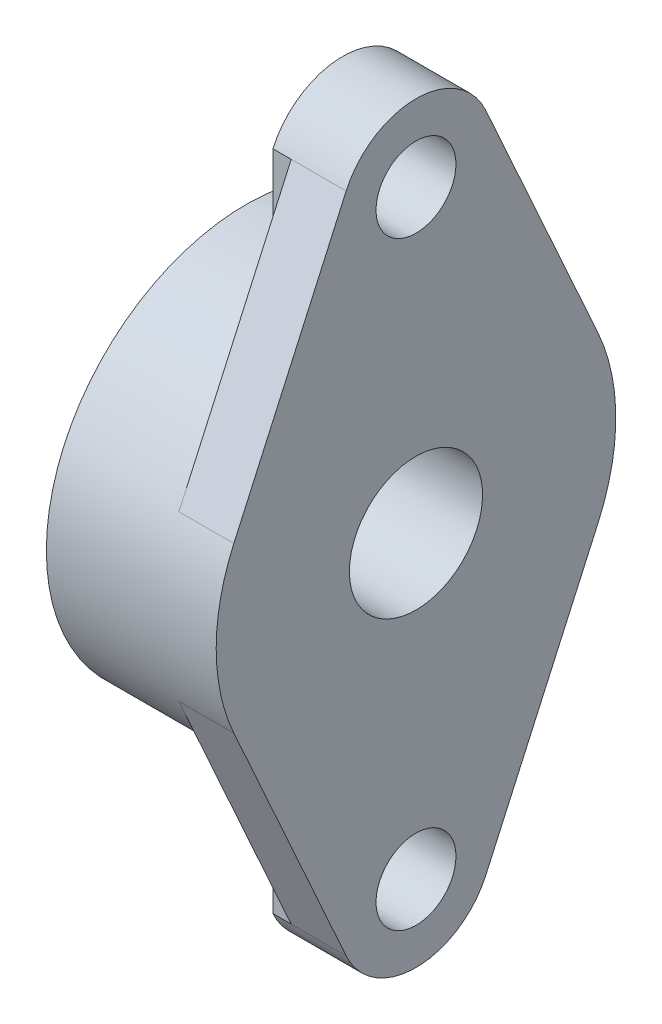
ISO-10303-21;
HEADER;
FILE_DESCRIPTION(('STEP AP214'),'2;1');
FILE_NAME('part.step','',(''),(''),'','','');
FILE_SCHEMA(('AUTOMOTIVE_DESIGN { 1 0 10303 214 1 1 1 1 }'));
ENDSEC;
DATA;
#1=APPLICATION_CONTEXT('core data for automotive mechanical design processes');
#2=APPLICATION_PROTOCOL_DEFINITION('international standard','automotive_design',2000,#1);
#3=PRODUCT_CONTEXT('',#1,'mechanical');
#4=PRODUCT('Part','Part','',(#3));
#5=PRODUCT_RELATED_PRODUCT_CATEGORY('part','',(#4));
#6=PRODUCT_DEFINITION_FORMATION('','',#4);
#7=PRODUCT_DEFINITION_CONTEXT('part definition',#1,'design');
#8=PRODUCT_DEFINITION('design','',#6,#7);
#9=PRODUCT_DEFINITION_SHAPE('','',#8);
#10=(LENGTH_UNIT() NAMED_UNIT(*) SI_UNIT(.MILLI.,.METRE.));
#11=(NAMED_UNIT(*) PLANE_ANGLE_UNIT() SI_UNIT($,.RADIAN.));
#12=(NAMED_UNIT(*) SI_UNIT($,.STERADIAN.) SOLID_ANGLE_UNIT());
#13=UNCERTAINTY_MEASURE_WITH_UNIT(LENGTH_MEASURE(1.E-05),#10,'distance_accuracy_value','');
#14=(GEOMETRIC_REPRESENTATION_CONTEXT(3) GLOBAL_UNCERTAINTY_ASSIGNED_CONTEXT((#13)) GLOBAL_UNIT_ASSIGNED_CONTEXT((#10,
#11,#12)) REPRESENTATION_CONTEXT('',''));
#15=CARTESIAN_POINT('',(0.,0.,0.));
#16=DIRECTION('',(0.,0.,1.));
#17=DIRECTION('',(1.,0.,0.));
#18=AXIS2_PLACEMENT_3D('',#15,#16,#17);
#19=CARTESIAN_POINT('',(-8.25,-49.9521254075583,-27.3475572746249));
#20=DIRECTION('',(-1.,0.,0.));
#21=DIRECTION('',(0.,0.,1.));
#22=AXIS2_PLACEMENT_3D('',#19,#20,#21);
#23=PLANE('',#22);
#24=DIRECTION('',(0.,-1.,0.));
#25=VECTOR('',#24,1.);
#26=CARTESIAN_POINT('',(-8.25,-38.9182643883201,-10.4832302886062));
#27=LINE('',#26,#25);
#28=CARTESIAN_POINT('',(-8.25,-28.1087509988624,-10.4832302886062));
#29=VERTEX_POINT('',#28);
#30=CARTESIAN_POINT('',(-8.25,-49.7277777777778,-10.4832302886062));
#31=VERTEX_POINT('',#30);
#32=EDGE_CURVE('E71',#29,#31,#27,.T.);
#33=ORIENTED_EDGE('',*,*,#32,.F.);
#34=CARTESIAN_POINT('',(-8.25,0.,0.));
#35=DIRECTION('',(-1.,0.,0.));
#36=DIRECTION('',(0.,0.,1.));
#37=AXIS2_PLACEMENT_3D('',#34,#35,#36);
#38=CIRCLE('',#37,30.);
#39=CARTESIAN_POINT('',(-8.25,-12.3365061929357,-27.3461262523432));
#40=VERTEX_POINT('',#39);
#41=EDGE_CURVE('E208',#40,#29,#38,.T.);
#42=ORIENTED_EDGE('',*,*,#41,.F.);
#43=DIRECTION('',(0.,0.911585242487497,-0.411111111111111));
#44=VECTOR('',#43,1.);
#45=CARTESIAN_POINT('',(-8.25,-31.0305555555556,-18.9153937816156));
#46=LINE('',#45,#44);
#47=EDGE_CURVE('E308',#31,#40,#46,.T.);
#48=ORIENTED_EDGE('',*,*,#47,.F.);
#49=EDGE_LOOP('',(#33,#42,#48));
#50=FACE_BOUND('',#49,.T.);
#51=ADVANCED_FACE('F16',(#50),#23,.T.);
#52=CARTESIAN_POINT('',(-11.,-49.7277777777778,-10.4832302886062));
#53=DIRECTION('',(0.,0.,-1.));
#54=DIRECTION('',(0.,1.,0.));
#55=AXIS2_PLACEMENT_3D('',#52,#53,#54);
#56=PLANE('',#55);
#57=DIRECTION('',(0.,-1.,0.));
#58=VECTOR('',#57,1.);
#59=CARTESIAN_POINT('',(-11.,-42.4463317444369,-10.4832302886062));
#60=LINE('',#59,#58);
#61=CARTESIAN_POINT('',(-11.,-28.1087509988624,-10.4832302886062));
#62=VERTEX_POINT('',#61);
#63=CARTESIAN_POINT('',(-11.,-49.7277777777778,-10.4832302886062));
#64=VERTEX_POINT('',#63);
#65=EDGE_CURVE('E65',#62,#64,#60,.T.);
#66=ORIENTED_EDGE('',*,*,#65,.F.);
#67=DIRECTION('',(-1.,0.,0.));
#68=VECTOR('',#67,1.);
#69=CARTESIAN_POINT('',(-12.75,-28.1087509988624,-10.4832302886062));
#70=LINE('',#69,#68);
#71=EDGE_CURVE('E300',#29,#62,#70,.T.);
#72=ORIENTED_EDGE('',*,*,#71,.F.);
#73=ORIENTED_EDGE('',*,*,#32,.T.);
#74=DIRECTION('',(1.,0.,0.));
#75=VECTOR('',#74,1.);
#76=CARTESIAN_POINT('',(-5.5,-49.7277777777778,-10.4832302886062));
#77=LINE('',#76,#75);
#78=EDGE_CURVE('E316',#64,#31,#77,.T.);
#79=ORIENTED_EDGE('',*,*,#78,.F.);
#80=EDGE_LOOP('',(#66,#72,#73,#79));
#81=FACE_BOUND('',#80,.T.);
#82=ADVANCED_FACE('F482',(#81),#56,.T.);
#83=CARTESIAN_POINT('',(-8.25,12.1121584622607,-27.3475572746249));
#84=DIRECTION('',(-1.,0.,0.));
#85=DIRECTION('',(0.,0.,1.));
#86=AXIS2_PLACEMENT_3D('',#83,#84,#85);
#87=PLANE('',#86);
#88=CARTESIAN_POINT('',(-8.25,0.,0.));
#89=DIRECTION('',(-1.,0.,0.));
#90=DIRECTION('',(0.,0.,1.));
#91=AXIS2_PLACEMENT_3D('',#88,#89,#90);
#92=CIRCLE('',#91,30.);
#93=CARTESIAN_POINT('',(-8.25,28.1087509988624,-10.4832302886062));
#94=VERTEX_POINT('',#93);
#95=CARTESIAN_POINT('',(-8.25,12.3365061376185,-27.3461262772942));
#96=VERTEX_POINT('',#95);
#97=EDGE_CURVE('E360',#94,#96,#92,.T.);
#98=ORIENTED_EDGE('',*,*,#97,.F.);
#99=DIRECTION('',(0.,-1.,0.));
#100=VECTOR('',#99,1.);
#101=CARTESIAN_POINT('',(-8.25,38.9182643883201,-10.4832302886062));
#102=LINE('',#101,#100);
#103=CARTESIAN_POINT('',(-8.25,49.7277777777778,-10.4832302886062));
#104=VERTEX_POINT('',#103);
#105=EDGE_CURVE('E270',#104,#94,#102,.T.);
#106=ORIENTED_EDGE('',*,*,#105,.F.);
#107=DIRECTION('',(0.,0.911585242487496,0.411111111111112));
#108=VECTOR('',#107,1.);
#109=CARTESIAN_POINT('',(-8.25,31.0305555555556,-18.9153937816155));
#110=LINE('',#109,#108);
#111=EDGE_CURVE('E203',#96,#104,#110,.T.);
#112=ORIENTED_EDGE('',*,*,#111,.F.);
#113=EDGE_LOOP('',(#98,#106,#112));
#114=FACE_BOUND('',#113,.T.);
#115=ADVANCED_FACE('F371',(#114),#87,.T.);
#116=CARTESIAN_POINT('',(-11.,28.1087509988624,-10.4832302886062));
#117=DIRECTION('',(0.,0.,-1.));
#118=DIRECTION('',(0.,1.,0.));
#119=AXIS2_PLACEMENT_3D('',#116,#117,#118);
#120=PLANE('',#119);
#121=DIRECTION('',(0.,-1.,0.));
#122=VECTOR('',#121,1.);
#123=CARTESIAN_POINT('',(-11.,42.4463317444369,-10.4832302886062));
#124=LINE('',#123,#122);
#125=CARTESIAN_POINT('',(-11.,49.7277777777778,-10.4832302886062));
#126=VERTEX_POINT('',#125);
#127=CARTESIAN_POINT('',(-11.,28.1087509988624,-10.4832302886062));
#128=VERTEX_POINT('',#127);
#129=EDGE_CURVE('E245',#126,#128,#124,.T.);
#130=ORIENTED_EDGE('',*,*,#129,.F.);
#131=DIRECTION('',(-1.,0.,0.));
#132=VECTOR('',#131,1.);
#133=CARTESIAN_POINT('',(-5.5,49.7277777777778,-10.4832302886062));
#134=LINE('',#133,#132);
#135=EDGE_CURVE('E197',#104,#126,#134,.T.);
#136=ORIENTED_EDGE('',*,*,#135,.F.);
#137=ORIENTED_EDGE('',*,*,#105,.T.);
#138=DIRECTION('',(1.,0.,0.));
#139=VECTOR('',#138,1.);
#140=CARTESIAN_POINT('',(-12.75,28.1087509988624,-10.4832302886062));
#141=LINE('',#140,#139);
#142=EDGE_CURVE('E215',#128,#94,#141,.T.);
#143=ORIENTED_EDGE('',*,*,#142,.F.);
#144=EDGE_LOOP('',(#130,#136,#137,#143));
#145=FACE_BOUND('',#144,.T.);
#146=ADVANCED_FACE('F366',(#145),#120,.T.);
#147=CARTESIAN_POINT('',(-11.,-28.1087509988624,10.4832302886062));
#148=DIRECTION('',(0.,0.,1.));
#149=DIRECTION('',(0.,-1.,0.));
#150=AXIS2_PLACEMENT_3D('',#147,#148,#149);
#151=PLANE('',#150);
#152=DIRECTION('',(0.,1.,0.));
#153=VECTOR('',#152,1.);
#154=CARTESIAN_POINT('',(-11.,-42.4463317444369,10.4832302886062));
#155=LINE('',#154,#153);
#156=CARTESIAN_POINT('',(-11.,-49.7277777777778,10.4832302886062));
#157=VERTEX_POINT('',#156);
#158=CARTESIAN_POINT('',(-11.,-28.1087509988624,10.4832302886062));
#159=VERTEX_POINT('',#158);
#160=EDGE_CURVE('E59',#157,#159,#155,.T.);
#161=ORIENTED_EDGE('',*,*,#160,.F.);
#162=DIRECTION('',(-1.,0.,0.));
#163=VECTOR('',#162,1.);
#164=CARTESIAN_POINT('',(-5.5,-49.7277777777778,10.4832302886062));
#165=LINE('',#164,#163);
#166=CARTESIAN_POINT('',(-8.25,-49.7277777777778,10.4832302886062));
#167=VERTEX_POINT('',#166);
#168=EDGE_CURVE('E257',#167,#157,#165,.T.);
#169=ORIENTED_EDGE('',*,*,#168,.F.);
#170=DIRECTION('',(0.,1.,0.));
#171=VECTOR('',#170,1.);
#172=CARTESIAN_POINT('',(-8.25,-49.7277777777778,10.4832302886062));
#173=LINE('',#172,#171);
#174=CARTESIAN_POINT('',(-8.25,-28.1087509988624,10.4832302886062));
#175=VERTEX_POINT('',#174);
#176=EDGE_CURVE('E251',#175,#167,#173,.F.);
#177=ORIENTED_EDGE('',*,*,#176,.F.);
#178=DIRECTION('',(1.,0.,0.));
#179=VECTOR('',#178,1.);
#180=CARTESIAN_POINT('',(-12.75,-28.1087509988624,10.4832302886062));
#181=LINE('',#180,#179);
#182=EDGE_CURVE('E277',#159,#175,#181,.T.);
#183=ORIENTED_EDGE('',*,*,#182,.F.);
#184=EDGE_LOOP('',(#161,#169,#177,#183));
#185=FACE_BOUND('',#184,.T.);
#186=ADVANCED_FACE('F432',(#185),#151,.T.);
#187=CARTESIAN_POINT('',(-8.25,12.1121585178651,10.4832302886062));
#188=DIRECTION('',(-1.,0.,0.));
#189=DIRECTION('',(0.,0.,1.));
#190=AXIS2_PLACEMENT_3D('',#187,#188,#189);
#191=PLANE('',#190);
#192=DIRECTION('',(0.,1.,0.));
#193=VECTOR('',#192,1.);
#194=CARTESIAN_POINT('',(-8.25,38.9182643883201,10.4832302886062));
#195=LINE('',#194,#193);
#196=CARTESIAN_POINT('',(-8.25,28.1087509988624,10.4832302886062));
#197=VERTEX_POINT('',#196);
#198=CARTESIAN_POINT('',(-8.25,49.7277777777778,10.4832302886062));
#199=VERTEX_POINT('',#198);
#200=EDGE_CURVE('E133',#197,#199,#195,.T.);
#201=ORIENTED_EDGE('',*,*,#200,.F.);
#202=CARTESIAN_POINT('',(-8.25,0.,0.));
#203=DIRECTION('',(-1.,0.,0.));
#204=DIRECTION('',(0.,0.,1.));
#205=AXIS2_PLACEMENT_3D('',#202,#203,#204);
#206=CIRCLE('',#205,30.);
#207=CARTESIAN_POINT('',(-8.25,12.3365061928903,27.3461262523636));
#208=VERTEX_POINT('',#207);
#209=EDGE_CURVE('E184',#208,#197,#206,.T.);
#210=ORIENTED_EDGE('',*,*,#209,.F.);
#211=DIRECTION('',(0.,-0.911585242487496,0.411111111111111));
#212=VECTOR('',#211,1.);
#213=CARTESIAN_POINT('',(-8.25,31.0305555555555,18.9153937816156));
#214=LINE('',#213,#212);
#215=EDGE_CURVE('E274',#199,#208,#214,.T.);
#216=ORIENTED_EDGE('',*,*,#215,.F.);
#217=EDGE_LOOP('',(#201,#210,#216));
#218=FACE_BOUND('',#217,.T.);
#219=ADVANCED_FACE('F420',(#218),#191,.T.);
#220=CARTESIAN_POINT('',(-11.,49.7277777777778,10.4832302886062));
#221=DIRECTION('',(0.,0.,1.));
#222=DIRECTION('',(0.,-1.,0.));
#223=AXIS2_PLACEMENT_3D('',#220,#221,#222);
#224=PLANE('',#223);
#225=DIRECTION('',(0.,1.,0.));
#226=VECTOR('',#225,1.);
#227=CARTESIAN_POINT('',(-11.,42.4463317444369,10.4832302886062));
#228=LINE('',#227,#226);
#229=CARTESIAN_POINT('',(-11.,28.1087509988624,10.4832302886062));
#230=VERTEX_POINT('',#229);
#231=CARTESIAN_POINT('',(-11.,49.7277777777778,10.4832302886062));
#232=VERTEX_POINT('',#231);
#233=EDGE_CURVE('E128',#230,#232,#228,.T.);
#234=ORIENTED_EDGE('',*,*,#233,.F.);
#235=DIRECTION('',(-1.,0.,0.));
#236=VECTOR('',#235,1.);
#237=CARTESIAN_POINT('',(-12.75,28.1087509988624,10.4832302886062));
#238=LINE('',#237,#236);
#239=EDGE_CURVE('E267',#197,#230,#238,.T.);
#240=ORIENTED_EDGE('',*,*,#239,.F.);
#241=ORIENTED_EDGE('',*,*,#200,.T.);
#242=DIRECTION('',(1.,0.,0.));
#243=VECTOR('',#242,1.);
#244=CARTESIAN_POINT('',(-5.5,49.7277777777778,10.4832302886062));
#245=LINE('',#244,#243);
#246=EDGE_CURVE('E284',#232,#199,#245,.T.);
#247=ORIENTED_EDGE('',*,*,#246,.F.);
#248=EDGE_LOOP('',(#234,#240,#241,#247));
#249=FACE_BOUND('',#248,.T.);
#250=ADVANCED_FACE('F424',(#249),#224,.T.);
#251=CARTESIAN_POINT('',(-8.25,-49.9521254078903,10.4832302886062));
#252=DIRECTION('',(-1.,0.,0.));
#253=DIRECTION('',(0.,0.,1.));
#254=AXIS2_PLACEMENT_3D('',#251,#252,#253);
#255=PLANE('',#254);
#256=CARTESIAN_POINT('',(-8.25,0.,0.));
#257=DIRECTION('',(-1.,0.,0.));
#258=DIRECTION('',(0.,0.,1.));
#259=AXIS2_PLACEMENT_3D('',#256,#257,#258);
#260=CIRCLE('',#259,30.);
#261=CARTESIAN_POINT('',(-8.25,-12.3365061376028,27.3461262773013));
#262=VERTEX_POINT('',#261);
#263=EDGE_CURVE('E154',#175,#262,#260,.T.);
#264=ORIENTED_EDGE('',*,*,#263,.F.);
#265=ORIENTED_EDGE('',*,*,#176,.T.);
#266=DIRECTION('',(0.,-0.911585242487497,-0.411111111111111));
#267=VECTOR('',#266,1.);
#268=CARTESIAN_POINT('',(-8.25,-31.0305555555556,18.9153937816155));
#269=LINE('',#268,#267);
#270=EDGE_CURVE('E171',#262,#167,#269,.T.);
#271=ORIENTED_EDGE('',*,*,#270,.F.);
#272=EDGE_LOOP('',(#264,#265,#271));
#273=FACE_BOUND('',#272,.T.);
#274=ADVANCED_FACE('F238',(#273),#255,.T.);
#275=CARTESIAN_POINT('',(-11.,28.1087509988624,10.4832302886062));
#276=CARTESIAN_POINT('',(-11.,56.5,10.4832302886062));
#277=CARTESIAN_POINT('',(-11.,56.7839124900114,10.4832302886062));
#278=B_SPLINE_CURVE_WITH_KNOTS('',1,(#275,#276,#277),.UNSPECIFIED.,.F.,.F.,(2,1,2),(0.,1.,1.01),.UNSPECIFIED.);
#279=DIRECTION('',(0.,0.,-1.));
#280=VECTOR('',#279,1.);
#281=SURFACE_OF_LINEAR_EXTRUSION('',#278,#280);
#282=CARTESIAN_POINT('',(-11.,45.,0.));
#283=DIRECTION('',(1.,0.,0.));
#284=DIRECTION('',(0.,0.,-1.));
#285=AXIS2_PLACEMENT_3D('',#282,#283,#284);
#286=CIRCLE('',#285,6.00000000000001);
#287=CARTESIAN_POINT('',(-11.,45.,-6.00000000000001));
#288=VERTEX_POINT('',#287);
#289=EDGE_CURVE('E165',#288,#288,#286,.F.);
#290=ORIENTED_EDGE('',*,*,#289,.F.);
#291=EDGE_LOOP('',(#290));
#292=FACE_BOUND('',#291,.T.);
#293=ORIENTED_EDGE('',*,*,#129,.T.);
#294=CARTESIAN_POINT('',(-11.,0.,0.));
#295=DIRECTION('',(-1.,0.,0.));
#296=DIRECTION('',(0.,0.,1.));
#297=AXIS2_PLACEMENT_3D('',#294,#295,#296);
#298=CIRCLE('',#297,30.);
#299=EDGE_CURVE('E261',#230,#128,#298,.T.);
#300=ORIENTED_EDGE('',*,*,#299,.F.);
#301=ORIENTED_EDGE('',*,*,#233,.T.);
#302=CARTESIAN_POINT('',(-11.,45.,0.));
#303=DIRECTION('',(1.,0.,0.));
#304=DIRECTION('',(0.,0.,-1.));
#305=AXIS2_PLACEMENT_3D('',#302,#303,#304);
#306=CIRCLE('',#305,11.5);
#307=EDGE_CURVE('E288',#126,#232,#306,.T.);
#308=ORIENTED_EDGE('',*,*,#307,.F.);
#309=EDGE_LOOP('',(#293,#300,#301,#308));
#310=FACE_BOUND('',#309,.T.);
#311=ADVANCED_FACE('F232',(#292,#310),#281,.T.);
#312=CARTESIAN_POINT('',(-11.,-56.7839124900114,10.4832302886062));
#313=CARTESIAN_POINT('',(-11.,-56.5,10.4832302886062));
#314=CARTESIAN_POINT('',(-11.,-28.1087509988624,10.4832302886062));
#315=B_SPLINE_CURVE_WITH_KNOTS('',1,(#312,#313,#314),.UNSPECIFIED.,.F.,.F.,(2,1,2),(-0.01,0.,
1.),.UNSPECIFIED.);
#316=DIRECTION('',(0.,0.,-1.));
#317=VECTOR('',#316,1.);
#318=SURFACE_OF_LINEAR_EXTRUSION('',#315,#317);
#319=CARTESIAN_POINT('',(-11.,-45.,0.));
#320=DIRECTION('',(1.,0.,0.));
#321=DIRECTION('',(0.,0.,-1.));
#322=AXIS2_PLACEMENT_3D('',#319,#320,#321);
#323=CIRCLE('',#322,6.);
#324=CARTESIAN_POINT('',(-11.,-45.,-6.));
#325=VERTEX_POINT('',#324);
#326=EDGE_CURVE('E169',#325,#325,#323,.F.);
#327=ORIENTED_EDGE('',*,*,#326,.F.);
#328=EDGE_LOOP('',(#327));
#329=FACE_BOUND('',#328,.T.);
#330=ORIENTED_EDGE('',*,*,#65,.T.);
#331=CARTESIAN_POINT('',(-11.,-45.,0.));
#332=DIRECTION('',(1.,0.,0.));
#333=DIRECTION('',(0.,0.,-1.));
#334=AXIS2_PLACEMENT_3D('',#331,#332,#333);
#335=CIRCLE('',#334,11.5);
#336=EDGE_CURVE('E19',#157,#64,#335,.T.);
#337=ORIENTED_EDGE('',*,*,#336,.F.);
#338=ORIENTED_EDGE('',*,*,#160,.T.);
#339=CARTESIAN_POINT('',(-11.,0.,0.));
#340=DIRECTION('',(-1.,0.,0.));
#341=DIRECTION('',(0.,0.,1.));
#342=AXIS2_PLACEMENT_3D('',#339,#340,#341);
#343=CIRCLE('',#342,30.);
#344=EDGE_CURVE('E353',#62,#159,#343,.T.);
#345=ORIENTED_EDGE('',*,*,#344,.F.);
#346=EDGE_LOOP('',(#330,#337,#338,#345));
#347=FACE_BOUND('',#346,.T.);
#348=ADVANCED_FACE('F227',(#329,#347),#318,.T.);
#349=CARTESIAN_POINT('',(-25.5,-30.,30.3600010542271));
#350=DIRECTION('',(-1.,0.,0.));
#351=DIRECTION('',(0.,1.,0.));
#352=AXIS2_PLACEMENT_3D('',#349,#350,#351);
#353=PLANE('',#352);
#354=CARTESIAN_POINT('',(-25.5,0.,0.));
#355=DIRECTION('',(-1.,0.,0.));
#356=DIRECTION('',(0.,0.,1.));
#357=AXIS2_PLACEMENT_3D('',#354,#355,#356);
#358=CIRCLE('',#357,15.);
#359=CARTESIAN_POINT('',(-25.5,0.,15.));
#360=VERTEX_POINT('',#359);
#361=EDGE_CURVE('E344',#360,#360,#358,.T.);
#362=ORIENTED_EDGE('',*,*,#361,.F.);
#363=EDGE_LOOP('',(#362));
#364=FACE_BOUND('',#363,.T.);
#365=CARTESIAN_POINT('',(-25.5,0.,0.));
#366=DIRECTION('',(-1.,0.,0.));
#367=DIRECTION('',(0.,0.,1.));
#368=AXIS2_PLACEMENT_3D('',#365,#366,#367);
#369=CIRCLE('',#368,30.);
#370=CARTESIAN_POINT('',(-25.5,0.,30.));
#371=VERTEX_POINT('',#370);
#372=EDGE_CURVE('E190',#371,#371,#369,.F.);
#373=ORIENTED_EDGE('',*,*,#372,.F.);
#374=EDGE_LOOP('',(#373));
#375=FACE_BOUND('',#374,.T.);
#376=ADVANCED_FACE('F231',(#364,#375),#353,.T.);
#377=CARTESIAN_POINT('',(0.,-45.,0.));
#378=DIRECTION('',(1.,0.,0.));
#379=DIRECTION('',(0.,0.,-1.));
#380=AXIS2_PLACEMENT_3D('',#377,#378,#379);
#381=CYLINDRICAL_SURFACE('',#380,11.5);
#382=ORIENTED_EDGE('',*,*,#336,.T.);
#383=ORIENTED_EDGE('',*,*,#78,.T.);
#384=DIRECTION('',(1.,0.,0.));
#385=VECTOR('',#384,1.);
#386=CARTESIAN_POINT('',(-8.25,-49.7277777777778,-10.4832302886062));
#387=LINE('',#386,#385);
#388=CARTESIAN_POINT('',(0.,-49.7277777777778,-10.4832302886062));
#389=VERTEX_POINT('',#388);
#390=EDGE_CURVE('E212',#389,#31,#387,.F.);
#391=ORIENTED_EDGE('',*,*,#390,.F.);
#392=CARTESIAN_POINT('',(0.,-45.,0.));
#393=DIRECTION('',(1.,0.,0.));
#394=DIRECTION('',(0.,0.,-1.));
#395=AXIS2_PLACEMENT_3D('',#392,#393,#394);
#396=CIRCLE('',#395,11.5);
#397=CARTESIAN_POINT('',(0.,-49.7277777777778,10.4832302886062));
#398=VERTEX_POINT('',#397);
#399=EDGE_CURVE('E341',#398,#389,#396,.T.);
#400=ORIENTED_EDGE('',*,*,#399,.F.);
#401=DIRECTION('',(1.,0.,0.));
#402=VECTOR('',#401,1.);
#403=CARTESIAN_POINT('',(-8.25,-49.7277777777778,10.4832302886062));
#404=LINE('',#403,#402);
#405=EDGE_CURVE('E166',#167,#398,#404,.T.);
#406=ORIENTED_EDGE('',*,*,#405,.F.);
#407=ORIENTED_EDGE('',*,*,#168,.T.);
#408=EDGE_LOOP('',(#382,#383,#391,#400,#406,#407));
#409=FACE_BOUND('',#408,.T.);
#410=ADVANCED_FACE('F454',(#409),#381,.T.);
#411=CARTESIAN_POINT('',(-8.25,-49.7277777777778,-10.4832302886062));
#412=DIRECTION('',(0.,-0.411111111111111,-0.911585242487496));
#413=DIRECTION('',(0.,0.911585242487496,-0.411111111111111));
#414=AXIS2_PLACEMENT_3D('',#411,#412,#413);
#415=PLANE('',#414);
#416=CARTESIAN_POINT('',(0.,-49.7277777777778,-10.4832302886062));
#417=CARTESIAN_POINT('',(0.,-48.1696759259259,-11.1859105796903));
#418=CARTESIAN_POINT('',(0.,-46.6115740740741,-11.8885908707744));
#419=CARTESIAN_POINT('',(0.,-43.4953703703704,-13.2939514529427));
#420=CARTESIAN_POINT('',(0.,-41.9372685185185,-13.9966317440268));
#421=CARTESIAN_POINT('',(0.,-38.8210648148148,-15.401992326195));
#422=CARTESIAN_POINT('',(0.,-37.262962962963,-16.1046726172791));
#423=CARTESIAN_POINT('',(0.,-34.1467592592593,-17.5100331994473));
#424=CARTESIAN_POINT('',(0.,-32.5886574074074,-18.2127134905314));
#425=CARTESIAN_POINT('',(0.,-29.4724537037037,-19.6180740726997));
#426=CARTESIAN_POINT('',(0.,-27.9143518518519,-20.3207543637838));
#427=CARTESIAN_POINT('',(0.,-24.7981481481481,-21.726114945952));
#428=CARTESIAN_POINT('',(0.,-23.2400462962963,-22.4287952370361));
#429=CARTESIAN_POINT('',(0.,-20.1238425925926,-23.8341558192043));
#430=CARTESIAN_POINT('',(0.,-18.5657407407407,-24.5368361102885));
#431=CARTESIAN_POINT('',(0.,-15.449537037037,-25.9421966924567));
#432=CARTESIAN_POINT('',(0.,-13.8914351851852,-26.6448769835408));
#433=CARTESIAN_POINT('',(0.,-12.3333333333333,-27.3475572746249));
#434=B_SPLINE_CURVE_WITH_KNOTS('',3,(#416,#417,#418,#419,#420,#421,#422,#423,#424,#425,#426,
#427,#428,#429,#430,#431,#432,#433),.UNSPECIFIED.,.F.,.F.,(4,2,2,2,2,2,2,2,4),(0.,
5.12766698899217,10.2553339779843,15.3830009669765,20.5106679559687,25.6383349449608,
30.766001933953,35.8936689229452,41.0213359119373),.UNSPECIFIED.);
#435=CARTESIAN_POINT('',(0.,-12.3333333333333,-27.3475572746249));
#436=VERTEX_POINT('',#435);
#437=EDGE_CURVE('E340',#389,#436,#434,.T.);
#438=ORIENTED_EDGE('',*,*,#437,.F.);
#439=ORIENTED_EDGE('',*,*,#390,.T.);
#440=ORIENTED_EDGE('',*,*,#47,.T.);
#441=CARTESIAN_POINT('',(-8.25,-12.3333333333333,-27.3475572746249));
#442=VERTEX_POINT('',#441);
#443=EDGE_CURVE('E34',#40,#442,#46,.T.);
#444=ORIENTED_EDGE('',*,*,#443,.T.);
#445=DIRECTION('',(-1.,0.,0.));
#446=VECTOR('',#445,1.);
#447=CARTESIAN_POINT('',(-12.75,-12.3333333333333,-27.3475572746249));
#448=LINE('',#447,#446);
#449=EDGE_CURVE('E206',#436,#442,#448,.T.);
#450=ORIENTED_EDGE('',*,*,#449,.F.);
#451=EDGE_LOOP('',(#438,#439,#440,#444,#450));
#452=FACE_BOUND('',#451,.T.);
#453=ADVANCED_FACE('F472',(#452),#415,.T.);
#454=CARTESIAN_POINT('',(-8.25,12.3333333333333,-27.3475572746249));
#455=DIRECTION('',(0.,0.411111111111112,-0.911585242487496));
#456=DIRECTION('',(0.,0.911585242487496,0.411111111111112));
#457=AXIS2_PLACEMENT_3D('',#454,#455,#456);
#458=PLANE('',#457);
#459=CARTESIAN_POINT('',(0.,12.3333333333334,-27.3475572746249));
#460=CARTESIAN_POINT('',(0.,13.8914351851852,-26.6448769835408));
#461=CARTESIAN_POINT('',(0.,15.4495370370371,-25.9421966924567));
#462=CARTESIAN_POINT('',(0.,18.5657407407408,-24.5368361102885));
#463=CARTESIAN_POINT('',(0.,20.1238425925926,-23.8341558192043));
#464=CARTESIAN_POINT('',(0.,23.2400462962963,-22.4287952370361));
#465=CARTESIAN_POINT('',(0.,24.7981481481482,-21.726114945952));
#466=CARTESIAN_POINT('',(0.,27.9143518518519,-20.3207543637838));
#467=CARTESIAN_POINT('',(0.,29.4724537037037,-19.6180740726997));
#468=CARTESIAN_POINT('',(0.,32.5886574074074,-18.2127134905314));
#469=CARTESIAN_POINT('',(0.,34.1467592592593,-17.5100331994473));
#470=CARTESIAN_POINT('',(0.,37.262962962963,-16.1046726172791));
#471=CARTESIAN_POINT('',(0.,38.8210648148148,-15.401992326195));
#472=CARTESIAN_POINT('',(0.,41.9372685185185,-13.9966317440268));
#473=CARTESIAN_POINT('',(0.,43.4953703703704,-13.2939514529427));
#474=CARTESIAN_POINT('',(0.,46.6115740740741,-11.8885908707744));
#475=CARTESIAN_POINT('',(0.,48.1696759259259,-11.1859105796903));
#476=CARTESIAN_POINT('',(0.,49.7277777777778,-10.4832302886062));
#477=B_SPLINE_CURVE_WITH_KNOTS('',3,(#459,#460,#461,#462,#463,#464,#465,#466,#467,#468,#469,
#470,#471,#472,#473,#474,#475,#476),.UNSPECIFIED.,.F.,.F.,(4,2,2,2,2,2,2,2,4),(0.,
5.12766698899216,10.2553339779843,15.3830009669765,20.5106679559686,25.6383349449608,
30.766001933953,35.8936689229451,41.0213359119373),.UNSPECIFIED.);
#478=CARTESIAN_POINT('',(0.,12.3333333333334,-27.3475572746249));
#479=VERTEX_POINT('',#478);
#480=CARTESIAN_POINT('',(0.,49.7277777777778,-10.4832302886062));
#481=VERTEX_POINT('',#480);
#482=EDGE_CURVE('E336',#479,#481,#477,.T.);
#483=ORIENTED_EDGE('',*,*,#482,.F.);
#484=DIRECTION('',(1.,0.,0.));
#485=VECTOR('',#484,1.);
#486=CARTESIAN_POINT('',(-8.25,12.3333333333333,-27.3475572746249));
#487=LINE('',#486,#485);
#488=CARTESIAN_POINT('',(-8.25,12.3333333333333,-27.3475572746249));
#489=VERTEX_POINT('',#488);
#490=EDGE_CURVE('E198',#479,#489,#487,.F.);
#491=ORIENTED_EDGE('',*,*,#490,.T.);
#492=CARTESIAN_POINT('',(-8.25,0.,0.));
#493=DIRECTION('',(-1.,0.,0.));
#494=DIRECTION('',(0.,1.,0.));
#495=AXIS2_PLACEMENT_3D('',#492,#493,#494);
#496=CIRCLE('',#495,30.);
#497=EDGE_CURVE('E209',#96,#489,#496,.T.);
#498=ORIENTED_EDGE('',*,*,#497,.F.);
#499=ORIENTED_EDGE('',*,*,#111,.T.);
#500=DIRECTION('',(-1.,0.,0.));
#501=VECTOR('',#500,1.);
#502=CARTESIAN_POINT('',(-5.5,49.7277777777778,-10.4832302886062));
#503=LINE('',#502,#501);
#504=EDGE_CURVE('E194',#481,#104,#503,.T.);
#505=ORIENTED_EDGE('',*,*,#504,.F.);
#506=EDGE_LOOP('',(#483,#491,#498,#499,#505));
#507=FACE_BOUND('',#506,.T.);
#508=ADVANCED_FACE('F374',(#507),#458,.T.);
#509=CARTESIAN_POINT('',(0.,45.,0.));
#510=DIRECTION('',(1.,0.,0.));
#511=DIRECTION('',(0.,0.,-1.));
#512=AXIS2_PLACEMENT_3D('',#509,#510,#511);
#513=CYLINDRICAL_SURFACE('',#512,11.5);
#514=ORIENTED_EDGE('',*,*,#307,.T.);
#515=ORIENTED_EDGE('',*,*,#246,.T.);
#516=DIRECTION('',(1.,0.,0.));
#517=VECTOR('',#516,1.);
#518=CARTESIAN_POINT('',(-8.25,49.7277777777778,10.4832302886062));
#519=LINE('',#518,#517);
#520=CARTESIAN_POINT('',(0.,49.7277777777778,10.4832302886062));
#521=VERTEX_POINT('',#520);
#522=EDGE_CURVE('E187',#521,#199,#519,.F.);
#523=ORIENTED_EDGE('',*,*,#522,.F.);
#524=CARTESIAN_POINT('',(0.,45.,0.));
#525=DIRECTION('',(1.,0.,0.));
#526=DIRECTION('',(0.,0.,-1.));
#527=AXIS2_PLACEMENT_3D('',#524,#525,#526);
#528=CIRCLE('',#527,11.5);
#529=EDGE_CURVE('E333',#481,#521,#528,.T.);
#530=ORIENTED_EDGE('',*,*,#529,.F.);
#531=ORIENTED_EDGE('',*,*,#504,.T.);
#532=ORIENTED_EDGE('',*,*,#135,.T.);
#533=EDGE_LOOP('',(#514,#515,#523,#530,#531,#532));
#534=FACE_BOUND('',#533,.T.);
#535=ADVANCED_FACE('F423',(#534),#513,.T.);
#536=CARTESIAN_POINT('',(-8.25,49.7277777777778,10.4832302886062));
#537=DIRECTION('',(0.,0.411111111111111,0.911585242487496));
#538=DIRECTION('',(0.,-0.911585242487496,0.411111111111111));
#539=AXIS2_PLACEMENT_3D('',#536,#537,#538);
#540=PLANE('',#539);
#541=CARTESIAN_POINT('',(0.,49.7277777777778,10.4832302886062));
#542=CARTESIAN_POINT('',(0.,48.1696759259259,11.1859105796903));
#543=CARTESIAN_POINT('',(0.,46.6115740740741,11.8885908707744));
#544=CARTESIAN_POINT('',(0.,43.4953703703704,13.2939514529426));
#545=CARTESIAN_POINT('',(0.,41.9372685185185,13.9966317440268));
#546=CARTESIAN_POINT('',(0.,38.8210648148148,15.401992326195));
#547=CARTESIAN_POINT('',(0.,37.262962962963,16.1046726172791));
#548=CARTESIAN_POINT('',(0.,34.1467592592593,17.5100331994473));
#549=CARTESIAN_POINT('',(0.,32.5886574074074,18.2127134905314));
#550=CARTESIAN_POINT('',(0.,29.4724537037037,19.6180740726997));
#551=CARTESIAN_POINT('',(0.,27.9143518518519,20.3207543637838));
#552=CARTESIAN_POINT('',(0.,24.7981481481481,21.726114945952));
#553=CARTESIAN_POINT('',(0.,23.2400462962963,22.4287952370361));
#554=CARTESIAN_POINT('',(0.,20.1238425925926,23.8341558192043));
#555=CARTESIAN_POINT('',(0.,18.5657407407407,24.5368361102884));
#556=CARTESIAN_POINT('',(0.,15.449537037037,25.9421966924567));
#557=CARTESIAN_POINT('',(0.,13.8914351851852,26.6448769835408));
#558=CARTESIAN_POINT('',(0.,12.3333333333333,27.3475572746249));
#559=B_SPLINE_CURVE_WITH_KNOTS('',3,(#541,#542,#543,#544,#545,#546,#547,#548,#549,#550,#551,
#552,#553,#554,#555,#556,#557,#558),.UNSPECIFIED.,.F.,.F.,(4,2,2,2,2,2,2,2,4),(0.,
5.12766698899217,10.2553339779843,15.3830009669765,20.5106679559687,25.6383349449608,
30.766001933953,35.8936689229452,41.0213359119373),.UNSPECIFIED.);
#560=CARTESIAN_POINT('',(0.,12.3333333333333,27.3475572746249));
#561=VERTEX_POINT('',#560);
#562=EDGE_CURVE('E332',#521,#561,#559,.T.);
#563=ORIENTED_EDGE('',*,*,#562,.F.);
#564=ORIENTED_EDGE('',*,*,#522,.T.);
#565=ORIENTED_EDGE('',*,*,#215,.T.);
#566=CARTESIAN_POINT('',(-8.25,12.3333333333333,27.3475572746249));
#567=VERTEX_POINT('',#566);
#568=EDGE_CURVE('E191',#208,#567,#214,.T.);
#569=ORIENTED_EDGE('',*,*,#568,.T.);
#570=DIRECTION('',(-1.,0.,0.));
#571=VECTOR('',#570,1.);
#572=CARTESIAN_POINT('',(-12.75,12.3333333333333,27.3475572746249));
#573=LINE('',#572,#571);
#574=EDGE_CURVE('E158',#561,#567,#573,.T.);
#575=ORIENTED_EDGE('',*,*,#574,.F.);
#576=EDGE_LOOP('',(#563,#564,#565,#569,#575));
#577=FACE_BOUND('',#576,.T.);
#578=ADVANCED_FACE('F417',(#577),#540,.T.);
#579=CARTESIAN_POINT('',(-25.5,0.,0.));
#580=DIRECTION('',(-1.,0.,0.));
#581=DIRECTION('',(0.,0.,1.));
#582=AXIS2_PLACEMENT_3D('',#579,#580,#581);
#583=CYLINDRICAL_SURFACE('',#582,30.);
#584=ORIENTED_EDGE('',*,*,#372,.T.);
#585=EDGE_LOOP('',(#584));
#586=FACE_BOUND('',#585,.T.);
#587=ORIENTED_EDGE('',*,*,#239,.T.);
#588=ORIENTED_EDGE('',*,*,#299,.T.);
#589=ORIENTED_EDGE('',*,*,#142,.T.);
#590=ORIENTED_EDGE('',*,*,#97,.T.);
#591=ORIENTED_EDGE('',*,*,#497,.T.);
#592=ORIENTED_EDGE('',*,*,#490,.F.);
#593=CARTESIAN_POINT('',(0.,0.,0.));
#594=DIRECTION('',(-1.,0.,0.));
#595=DIRECTION('',(0.,0.,1.));
#596=AXIS2_PLACEMENT_3D('',#593,#594,#595);
#597=CIRCLE('',#596,30.);
#598=EDGE_CURVE('E337',#436,#479,#597,.F.);
#599=ORIENTED_EDGE('',*,*,#598,.F.);
#600=ORIENTED_EDGE('',*,*,#449,.T.);
#601=ORIENTED_EDGE('',*,*,#443,.F.);
#602=ORIENTED_EDGE('',*,*,#41,.T.);
#603=ORIENTED_EDGE('',*,*,#71,.T.);
#604=ORIENTED_EDGE('',*,*,#344,.T.);
#605=ORIENTED_EDGE('',*,*,#182,.T.);
#606=ORIENTED_EDGE('',*,*,#263,.T.);
#607=CARTESIAN_POINT('',(-8.25,0.,0.));
#608=DIRECTION('',(-1.,0.,0.));
#609=DIRECTION('',(0.,1.,0.));
#610=AXIS2_PLACEMENT_3D('',#607,#608,#609);
#611=CIRCLE('',#610,30.);
#612=CARTESIAN_POINT('',(-8.25,-12.3333333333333,27.3475572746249));
#613=VERTEX_POINT('',#612);
#614=EDGE_CURVE('E145',#262,#613,#611,.T.);
#615=ORIENTED_EDGE('',*,*,#614,.T.);
#616=DIRECTION('',(1.,0.,0.));
#617=VECTOR('',#616,1.);
#618=CARTESIAN_POINT('',(-8.25,-12.3333333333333,27.3475572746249));
#619=LINE('',#618,#617);
#620=CARTESIAN_POINT('',(0.,-12.3333333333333,27.3475572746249));
#621=VERTEX_POINT('',#620);
#622=EDGE_CURVE('E150',#621,#613,#619,.F.);
#623=ORIENTED_EDGE('',*,*,#622,.F.);
#624=CARTESIAN_POINT('',(0.,0.,0.));
#625=DIRECTION('',(-1.,0.,0.));
#626=DIRECTION('',(0.,0.,1.));
#627=AXIS2_PLACEMENT_3D('',#624,#625,#626);
#628=CIRCLE('',#627,30.);
#629=EDGE_CURVE('E330',#561,#621,#628,.F.);
#630=ORIENTED_EDGE('',*,*,#629,.F.);
#631=ORIENTED_EDGE('',*,*,#574,.T.);
#632=ORIENTED_EDGE('',*,*,#568,.F.);
#633=ORIENTED_EDGE('',*,*,#209,.T.);
#634=EDGE_LOOP('',(#587,#588,#589,#590,#591,#592,#599,#600,#601,#602,#603,#604,#605,#606,#615,
#623,#630,#631,#632,#633));
#635=FACE_BOUND('',#634,.T.);
#636=ADVANCED_FACE('F148',(#586,#635),#583,.T.);
#637=CARTESIAN_POINT('',(-8.25,-12.3333333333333,27.3475572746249));
#638=DIRECTION('',(0.,-0.411111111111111,0.911585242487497));
#639=DIRECTION('',(0.,-0.911585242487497,-0.411111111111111));
#640=AXIS2_PLACEMENT_3D('',#637,#638,#639);
#641=PLANE('',#640);
#642=CARTESIAN_POINT('',(0.,-12.3333333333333,27.3475572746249));
#643=CARTESIAN_POINT('',(0.,-13.8914351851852,26.6448769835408));
#644=CARTESIAN_POINT('',(0.,-15.449537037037,25.9421966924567));
#645=CARTESIAN_POINT('',(0.,-18.5657407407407,24.5368361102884));
#646=CARTESIAN_POINT('',(0.,-20.1238425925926,23.8341558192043));
#647=CARTESIAN_POINT('',(0.,-23.2400462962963,22.4287952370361));
#648=CARTESIAN_POINT('',(0.,-24.7981481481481,21.726114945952));
#649=CARTESIAN_POINT('',(0.,-27.9143518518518,20.3207543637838));
#650=CARTESIAN_POINT('',(0.,-29.4724537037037,19.6180740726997));
#651=CARTESIAN_POINT('',(0.,-32.5886574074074,18.2127134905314));
#652=CARTESIAN_POINT('',(0.,-34.1467592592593,17.5100331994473));
#653=CARTESIAN_POINT('',(0.,-37.262962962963,16.1046726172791));
#654=CARTESIAN_POINT('',(0.,-38.8210648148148,15.401992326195));
#655=CARTESIAN_POINT('',(0.,-41.9372685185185,13.9966317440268));
#656=CARTESIAN_POINT('',(0.,-43.4953703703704,13.2939514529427));
#657=CARTESIAN_POINT('',(0.,-46.6115740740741,11.8885908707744));
#658=CARTESIAN_POINT('',(0.,-48.1696759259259,11.1859105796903));
#659=CARTESIAN_POINT('',(0.,-49.7277777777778,10.4832302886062));
#660=B_SPLINE_CURVE_WITH_KNOTS('',3,(#642,#643,#644,#645,#646,#647,#648,#649,#650,#651,#652,
#653,#654,#655,#656,#657,#658,#659),.UNSPECIFIED.,.F.,.F.,(4,2,2,2,2,2,2,2,4),(0.,
5.12766698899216,10.2553339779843,15.3830009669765,20.5106679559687,25.6383349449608,
30.766001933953,35.8936689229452,41.0213359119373),.UNSPECIFIED.);
#661=EDGE_CURVE('E163',#621,#398,#660,.T.);
#662=ORIENTED_EDGE('',*,*,#661,.F.);
#663=ORIENTED_EDGE('',*,*,#622,.T.);
#664=ORIENTED_EDGE('',*,*,#614,.F.);
#665=ORIENTED_EDGE('',*,*,#270,.T.);
#666=ORIENTED_EDGE('',*,*,#405,.T.);
#667=EDGE_LOOP('',(#662,#663,#664,#665,#666));
#668=FACE_BOUND('',#667,.T.);
#669=ADVANCED_FACE('F160',(#668),#641,.T.);
#670=CARTESIAN_POINT('',(-11.,45.,0.));
#671=DIRECTION('',(1.,0.,0.));
#672=DIRECTION('',(0.,0.,-1.));
#673=AXIS2_PLACEMENT_3D('',#670,#671,#672);
#674=CYLINDRICAL_SURFACE('',#673,6.00000000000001);
#675=CARTESIAN_POINT('',(0.,45.,0.));
#676=DIRECTION('',(1.,0.,0.));
#677=DIRECTION('',(0.,0.,-1.));
#678=AXIS2_PLACEMENT_3D('',#675,#676,#677);
#679=CIRCLE('',#678,6.00000000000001);
#680=CARTESIAN_POINT('',(0.,45.,-6.00000000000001));
#681=VERTEX_POINT('',#680);
#682=EDGE_CURVE('E327',#681,#681,#679,.F.);
#683=ORIENTED_EDGE('',*,*,#682,.F.);
#684=EDGE_LOOP('',(#683));
#685=FACE_BOUND('',#684,.T.);
#686=ORIENTED_EDGE('',*,*,#289,.T.);
#687=EDGE_LOOP('',(#686));
#688=FACE_BOUND('',#687,.T.);
#689=ADVANCED_FACE('F463',(#685,#688),#674,.F.);
#690=CARTESIAN_POINT('',(-11.,-45.,0.));
#691=DIRECTION('',(1.,0.,0.));
#692=DIRECTION('',(0.,0.,-1.));
#693=AXIS2_PLACEMENT_3D('',#690,#691,#692);
#694=CYLINDRICAL_SURFACE('',#693,6.);
#695=CARTESIAN_POINT('',(0.,-45.,0.));
#696=DIRECTION('',(1.,0.,0.));
#697=DIRECTION('',(0.,0.,-1.));
#698=AXIS2_PLACEMENT_3D('',#695,#696,#697);
#699=CIRCLE('',#698,6.);
#700=CARTESIAN_POINT('',(0.,-45.,-6.));
#701=VERTEX_POINT('',#700);
#702=EDGE_CURVE('E324',#701,#701,#699,.F.);
#703=ORIENTED_EDGE('',*,*,#702,.F.);
#704=EDGE_LOOP('',(#703));
#705=FACE_BOUND('',#704,.T.);
#706=ORIENTED_EDGE('',*,*,#326,.T.);
#707=EDGE_LOOP('',(#706));
#708=FACE_BOUND('',#707,.T.);
#709=ADVANCED_FACE('F449',(#705,#708),#694,.F.);
#710=CARTESIAN_POINT('',(-33.3,0.,0.));
#711=DIRECTION('',(-1.,0.,0.));
#712=DIRECTION('',(0.,0.,1.));
#713=AXIS2_PLACEMENT_3D('',#710,#711,#712);
#714=CYLINDRICAL_SURFACE('',#713,15.);
#715=CARTESIAN_POINT('',(-33.3,0.,0.));
#716=DIRECTION('',(-1.,0.,0.));
#717=DIRECTION('',(0.,0.,1.));
#718=AXIS2_PLACEMENT_3D('',#715,#716,#717);
#719=CIRCLE('',#718,15.);
#720=CARTESIAN_POINT('',(-33.3,0.,15.));
#721=VERTEX_POINT('',#720);
#722=EDGE_CURVE('E321',#721,#721,#719,.T.);
#723=ORIENTED_EDGE('',*,*,#722,.F.);
#724=EDGE_LOOP('',(#723));
#725=FACE_BOUND('',#724,.T.);
#726=ORIENTED_EDGE('',*,*,#361,.T.);
#727=EDGE_LOOP('',(#726));
#728=FACE_BOUND('',#727,.T.);
#729=ADVANCED_FACE('F401',(#725,#728),#714,.T.);
#730=CARTESIAN_POINT('',(0.,57.6413,30.));
#731=CARTESIAN_POINT('',(0.,56.5,30.));
#732=CARTESIAN_POINT('',(0.,-56.5,30.));
#733=CARTESIAN_POINT('',(0.,-57.63,30.));
#734=B_SPLINE_CURVE_WITH_KNOTS('',1,(#730,#731,#732,#733),.UNSPECIFIED.,.F.,.F.,(2,1,1,2),
(-0.0101,0.,1.,1.01),.UNSPECIFIED.);
#735=DIRECTION('',(0.,0.,-1.));
#736=VECTOR('',#735,1.);
#737=SURFACE_OF_LINEAR_EXTRUSION('',#734,#736);
#738=CARTESIAN_POINT('',(0.,0.,0.));
#739=DIRECTION('',(-1.,0.,0.));
#740=DIRECTION('',(0.,0.,1.));
#741=AXIS2_PLACEMENT_3D('',#738,#739,#740);
#742=CIRCLE('',#741,10.);
#743=CARTESIAN_POINT('',(0.,0.,10.));
#744=VERTEX_POINT('',#743);
#745=EDGE_CURVE('E25',#744,#744,#742,.F.);
#746=ORIENTED_EDGE('',*,*,#745,.F.);
#747=EDGE_LOOP('',(#746));
#748=FACE_BOUND('',#747,.T.);
#749=ORIENTED_EDGE('',*,*,#702,.T.);
#750=EDGE_LOOP('',(#749));
#751=FACE_BOUND('',#750,.T.);
#752=ORIENTED_EDGE('',*,*,#682,.T.);
#753=EDGE_LOOP('',(#752));
#754=FACE_BOUND('',#753,.T.);
#755=ORIENTED_EDGE('',*,*,#629,.T.);
#756=ORIENTED_EDGE('',*,*,#661,.T.);
#757=ORIENTED_EDGE('',*,*,#399,.T.);
#758=ORIENTED_EDGE('',*,*,#437,.T.);
#759=ORIENTED_EDGE('',*,*,#598,.T.);
#760=ORIENTED_EDGE('',*,*,#482,.T.);
#761=ORIENTED_EDGE('',*,*,#529,.T.);
#762=ORIENTED_EDGE('',*,*,#562,.T.);
#763=EDGE_LOOP('',(#755,#756,#757,#758,#759,#760,#761,#762));
#764=FACE_BOUND('',#763,.T.);
#765=ADVANCED_FACE('F381',(#748,#751,#754,#764),#737,.T.);
#766=CARTESIAN_POINT('',(-33.3,-15.,15.1800021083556));
#767=DIRECTION('',(-1.,0.,0.));
#768=DIRECTION('',(0.,1.,0.));
#769=AXIS2_PLACEMENT_3D('',#766,#767,#768);
#770=PLANE('',#769);
#771=CARTESIAN_POINT('',(-33.3,0.,0.));
#772=DIRECTION('',(-1.,0.,0.));
#773=DIRECTION('',(0.,0.,1.));
#774=AXIS2_PLACEMENT_3D('',#771,#772,#773);
#775=CIRCLE('',#774,10.);
#776=CARTESIAN_POINT('',(-33.3,0.,10.));
#777=VERTEX_POINT('',#776);
#778=EDGE_CURVE('E10',#777,#777,#775,.T.);
#779=ORIENTED_EDGE('',*,*,#778,.F.);
#780=EDGE_LOOP('',(#779));
#781=FACE_BOUND('',#780,.T.);
#782=ORIENTED_EDGE('',*,*,#722,.T.);
#783=EDGE_LOOP('',(#782));
#784=FACE_BOUND('',#783,.T.);
#785=ADVANCED_FACE('F400',(#781,#784),#770,.T.);
#786=CARTESIAN_POINT('',(0.,0.,0.));
#787=DIRECTION('',(-1.,0.,0.));
#788=DIRECTION('',(0.,0.,1.));
#789=AXIS2_PLACEMENT_3D('',#786,#787,#788);
#790=CYLINDRICAL_SURFACE('',#789,10.);
#791=ORIENTED_EDGE('',*,*,#745,.T.);
#792=EDGE_LOOP('',(#791));
#793=FACE_BOUND('',#792,.T.);
#794=ORIENTED_EDGE('',*,*,#778,.T.);
#795=EDGE_LOOP('',(#794));
#796=FACE_BOUND('',#795,.T.);
#797=ADVANCED_FACE('F434',(#793,#796),#790,.F.);
#798=CLOSED_SHELL('',(#51,#82,#115,#146,#186,#219,#250,#274,#311,#348,#376,#410,#453,#508,#535,
#578,#636,#669,#689,#709,#729,#765,#785,#797));
#799=MANIFOLD_SOLID_BREP('B1',#798);
#800=ADVANCED_BREP_SHAPE_REPRESENTATION('',(#18,#799),#14);
#801=SHAPE_DEFINITION_REPRESENTATION(#9,#800);
ENDSEC;
END-ISO-10303-21;
